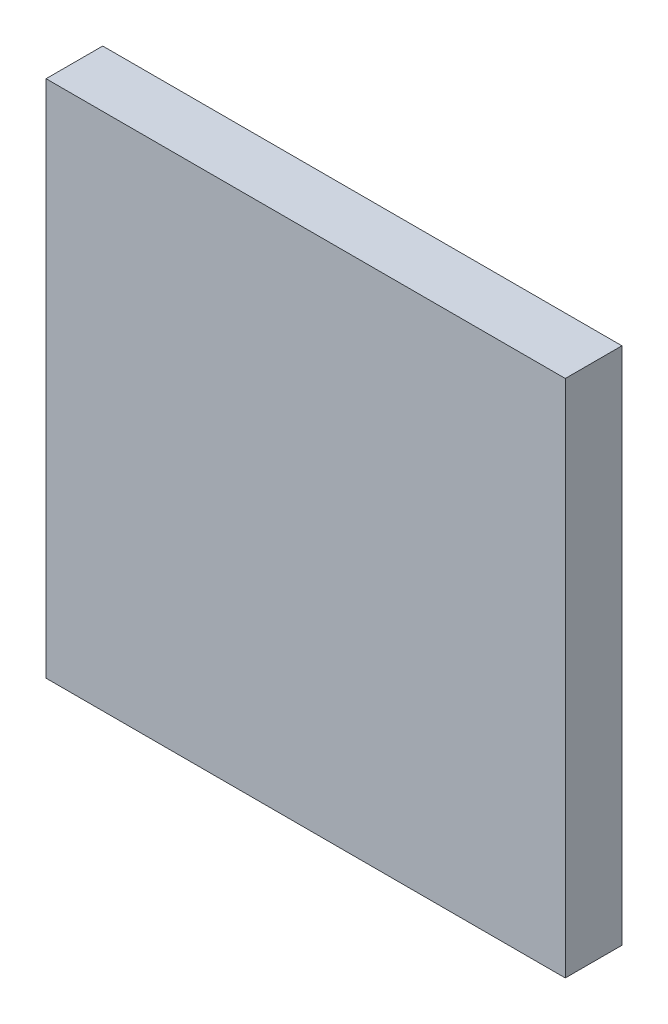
from build123d import *

# Parameters (mm, degrees)
ESQUISSE1_W          = 110
ESQUISSE1_H          = 110
BASE_EXTRUSION_DEPTH = 12


with BuildPart() as part:
    # Esquisse1 → Base-Extrusion (new body)
    with BuildSketch(Plane.XY):
        with Locations((55, 55)):
            Rectangle(ESQUISSE1_W, ESQUISSE1_H)
    extrude(amount=BASE_EXTRUSION_DEPTH)


solid = part.part
